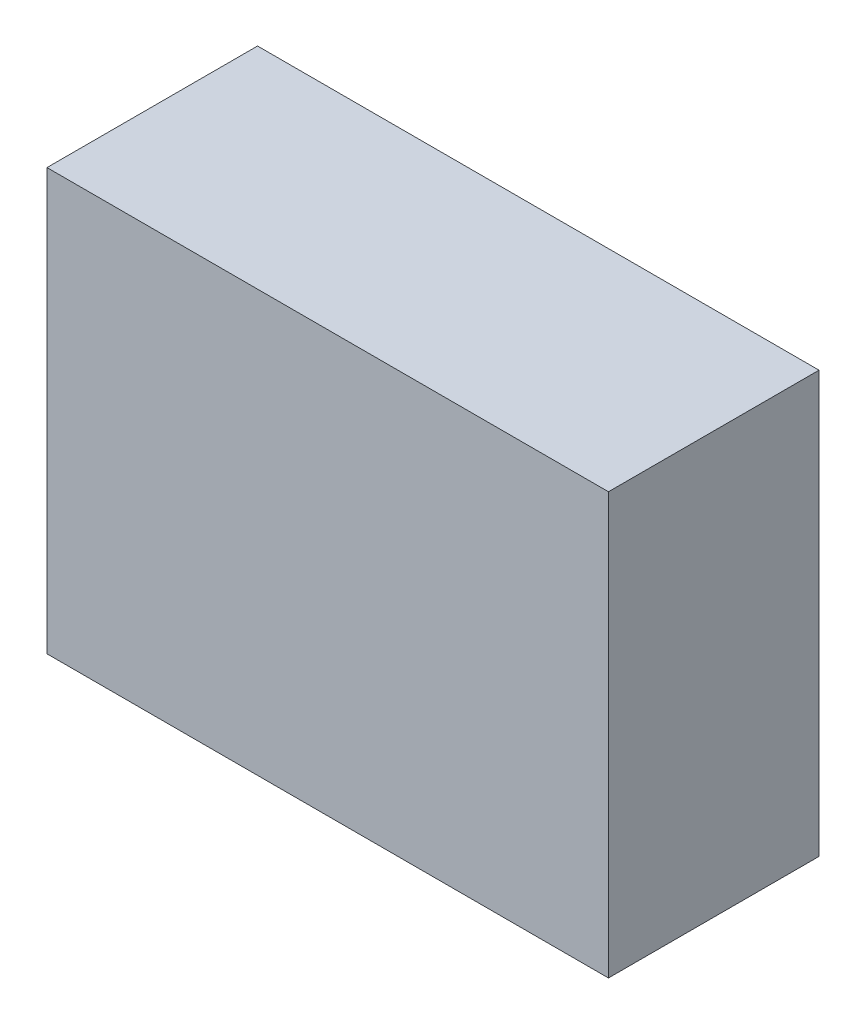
from build123d import *

# Parameters (mm, degrees)
SKIZZE1_W                       = 80
SKIZZE1_H                       = 60
AUFSATZ_LINEAR_AUSTRAGEN1_DEPTH = 30


with BuildPart() as part:
    # Skizze1 → Aufsatz-Linear austragen1 (new body)
    with BuildSketch(Plane.XY):
        with Locations((40, 30)):
            Rectangle(SKIZZE1_W, SKIZZE1_H)
    extrude(amount=AUFSATZ_LINEAR_AUSTRAGEN1_DEPTH)


solid = part.part
